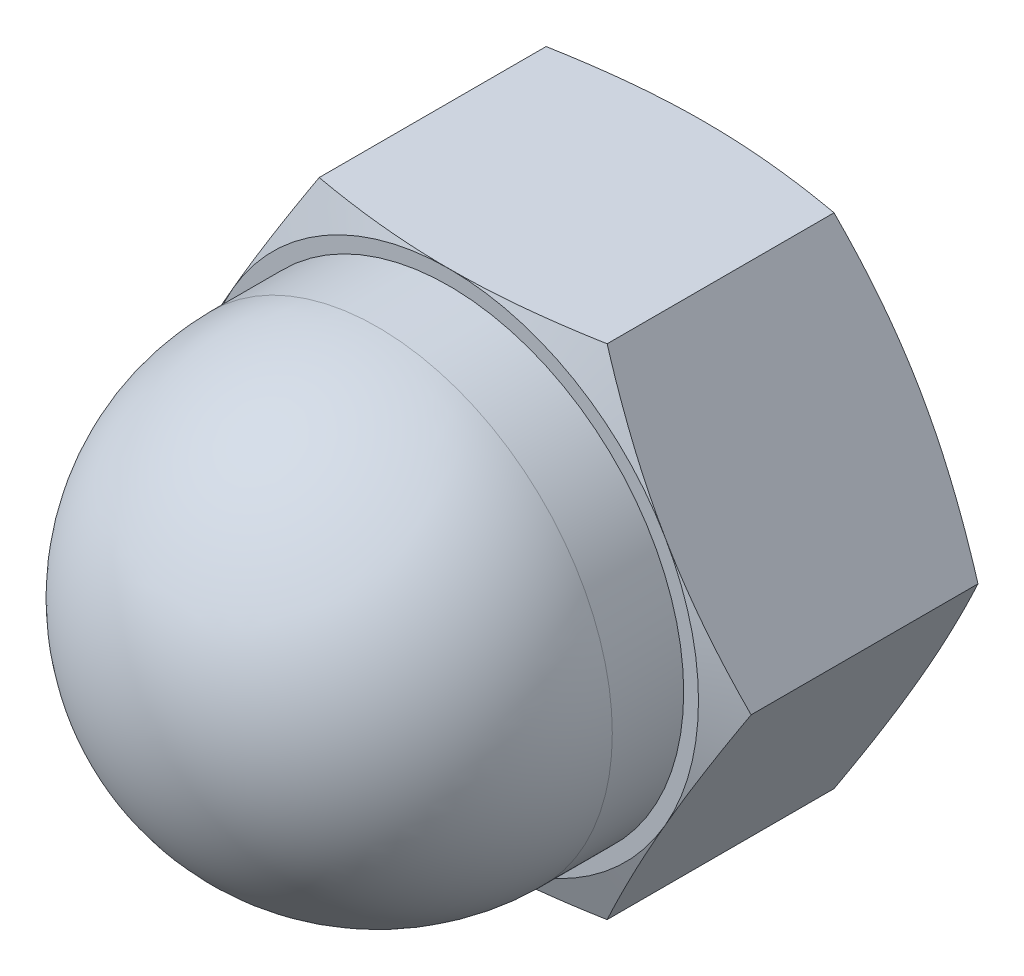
from build123d import *

# Parameters (mm, degrees)
SKETCH1_R        = 2.5
BASENUT_DEPTH    = 5
ENDCHAMFER_SIZE  = 0.65
ENDCHAMFER_SIZE2 = 0.375277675


with BuildPart() as part:
    # Sketch1 → BaseNut (new body)
    with BuildSketch(Plane.XY):
        Polygon((5.646485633, 0), (2.823242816, 4.89), (-2.823242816, 4.89), (-5.646485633, 0), (-2.823242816, -4.89), (2.823242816, -4.89), align=None)
        Circle(SKETCH1_R, mode=Mode.SUBTRACT)
    extrude(amount=-BASENUT_DEPTH)

    # Sketch2 → DoubleChamfer (revolve, cut)
    with BuildSketch(Plane(origin=(0, 0, 0), x_dir=(1, 0, 0), z_dir=(0, 1, 0))):
        Polygon((-4.89, 5), (-5.646485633, 5), (-5.646485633, 4.724661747), align=None)
        Polygon((-5.646485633, 0.275338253), (-4.89, 0), (-5.646485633, 0), align=None)
    revolve(axis=Axis((0, 0, -3.377940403), (0, 0, 1)), mode=Mode.SUBTRACT)

    # Sketch3 → Crown (revolve)
    with BuildSketch(Plane(origin=(-4.6, 0, -6), x_dir=(-1, 0, 0), z_dir=(0, 1, 0))):
        with BuildLine():
            Line((-9.2, 7.4), (-9.2, 6))
            Line((-9.2, 6), (-7.85, 6))
            Line((-7.85, 6), (-7.85, 8))
            Line((-7.85, 8), (-4.6, 11))
            Line((-4.6, 11), (-4.6, 12))
            ThreePointArc((-4.6, 12), (-7.852691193, 10.652691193), (-9.2, 7.4))
        make_face()
    revolve(axis=Axis((0, 0, 6), (0, 0, -1)))

    # EndChamfer
    endchamfer_edges = [part.edges().sort_by_distance(p)[0] for p in [
        (-2.5, 0, -5),
    ]]
    endchamfer_side = [part.faces().sort_by_distance(p)[0] for p in [
        (-2.5, 0, -2.5),
    ]]
    chamfer(endchamfer_edges, length=ENDCHAMFER_SIZE, length2=ENDCHAMFER_SIZE2, reference=endchamfer_side[0])


solid = part.part
